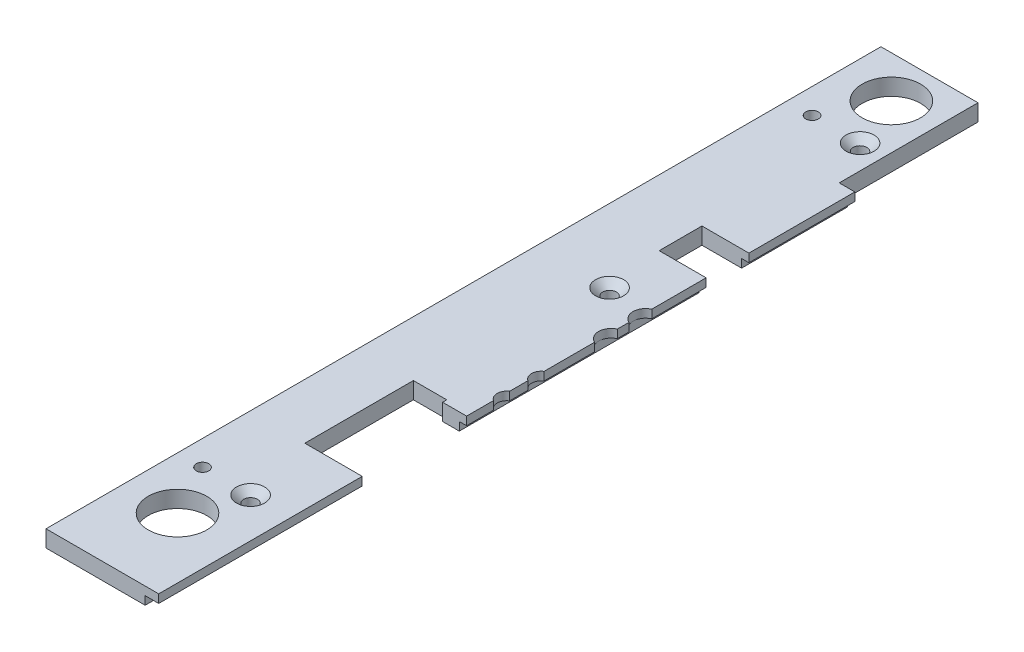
ISO-10303-21;
HEADER;
FILE_DESCRIPTION(('STEP AP214'),'2;1');
FILE_NAME('part.step','',(''),(''),'','','');
FILE_SCHEMA(('AUTOMOTIVE_DESIGN { 1 0 10303 214 1 1 1 1 }'));
ENDSEC;
DATA;
#1=APPLICATION_CONTEXT('core data for automotive mechanical design processes');
#2=APPLICATION_PROTOCOL_DEFINITION('international standard','automotive_design',2000,#1);
#3=PRODUCT_CONTEXT('',#1,'mechanical');
#4=PRODUCT('Part','Part','',(#3));
#5=PRODUCT_RELATED_PRODUCT_CATEGORY('part','',(#4));
#6=PRODUCT_DEFINITION_FORMATION('','',#4);
#7=PRODUCT_DEFINITION_CONTEXT('part definition',#1,'design');
#8=PRODUCT_DEFINITION('design','',#6,#7);
#9=PRODUCT_DEFINITION_SHAPE('','',#8);
#10=(LENGTH_UNIT() NAMED_UNIT(*) SI_UNIT(.MILLI.,.METRE.));
#11=(NAMED_UNIT(*) PLANE_ANGLE_UNIT() SI_UNIT($,.RADIAN.));
#12=(NAMED_UNIT(*) SI_UNIT($,.STERADIAN.) SOLID_ANGLE_UNIT());
#13=UNCERTAINTY_MEASURE_WITH_UNIT(LENGTH_MEASURE(1.E-05),#10,'distance_accuracy_value','');
#14=(GEOMETRIC_REPRESENTATION_CONTEXT(3) GLOBAL_UNCERTAINTY_ASSIGNED_CONTEXT((#13)) GLOBAL_UNIT_ASSIGNED_CONTEXT((#10,
#11,#12)) REPRESENTATION_CONTEXT('',''));
#15=CARTESIAN_POINT('',(0.,0.,0.));
#16=DIRECTION('',(0.,0.,1.));
#17=DIRECTION('',(1.,0.,0.));
#18=AXIS2_PLACEMENT_3D('',#15,#16,#17);
#19=CARTESIAN_POINT('',(54.,0.,400.));
#20=DIRECTION('',(-1.,0.,0.));
#21=DIRECTION('',(0.,0.,1.));
#22=AXIS2_PLACEMENT_3D('',#19,#20,#21);
#23=PLANE('',#22);
#24=DIRECTION('',(0.,1.,0.));
#25=VECTOR('',#24,1.);
#26=CARTESIAN_POINT('',(54.,0.,180.295643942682));
#27=LINE('',#26,#25);
#28=CARTESIAN_POINT('',(54.,8.00000000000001,180.295643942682));
#29=VERTEX_POINT('',#28);
#30=CARTESIAN_POINT('',(54.,4.,180.295643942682));
#31=VERTEX_POINT('',#30);
#32=EDGE_CURVE('E328',#29,#31,#27,.F.);
#33=ORIENTED_EDGE('',*,*,#32,.T.);
#34=DIRECTION('',(0.,0.,1.));
#35=VECTOR('',#34,1.);
#36=CARTESIAN_POINT('',(54.,4.,0.));
#37=LINE('',#36,#35);
#38=CARTESIAN_POINT('',(54.,4.,174.704356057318));
#39=VERTEX_POINT('',#38);
#40=EDGE_CURVE('E969',#39,#31,#37,.T.);
#41=ORIENTED_EDGE('',*,*,#40,.F.);
#42=DIRECTION('',(0.,1.,0.));
#43=VECTOR('',#42,1.);
#44=CARTESIAN_POINT('',(54.,0.,174.704356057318));
#45=LINE('',#44,#43);
#46=CARTESIAN_POINT('',(54.,8.00000000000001,174.704356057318));
#47=VERTEX_POINT('',#46);
#48=EDGE_CURVE('E325',#39,#47,#45,.T.);
#49=ORIENTED_EDGE('',*,*,#48,.T.);
#50=DIRECTION('',(0.,0.,-1.));
#51=VECTOR('',#50,1.);
#52=CARTESIAN_POINT('',(54.,8.00000000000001,400.));
#53=LINE('',#52,#51);
#54=EDGE_CURVE('E449',#29,#47,#53,.T.);
#55=ORIENTED_EDGE('',*,*,#54,.F.);
#56=EDGE_LOOP('',(#33,#41,#49,#55));
#57=FACE_BOUND('',#56,.T.);
#58=ADVANCED_FACE('F33',(#57),#23,.F.);
#59=DIRECTION('',(0.,1.,0.));
#60=VECTOR('',#59,1.);
#61=CARTESIAN_POINT('',(54.,0.,215.388653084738));
#62=LINE('',#61,#60);
#63=CARTESIAN_POINT('',(54.,8.00000000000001,215.388653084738));
#64=VERTEX_POINT('',#63);
#65=CARTESIAN_POINT('',(54.,4.,215.388653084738));
#66=VERTEX_POINT('',#65);
#67=EDGE_CURVE('E378',#64,#66,#62,.F.);
#68=ORIENTED_EDGE('',*,*,#67,.T.);
#69=CARTESIAN_POINT('',(54.,4.,191.204356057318));
#70=VERTEX_POINT('',#69);
#71=EDGE_CURVE('E966',#70,#66,#37,.T.);
#72=ORIENTED_EDGE('',*,*,#71,.F.);
#73=DIRECTION('',(0.,1.,0.));
#74=VECTOR('',#73,1.);
#75=CARTESIAN_POINT('',(54.,0.,191.204356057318));
#76=LINE('',#75,#74);
#77=CARTESIAN_POINT('',(54.,8.00000000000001,191.204356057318));
#78=VERTEX_POINT('',#77);
#79=EDGE_CURVE('E338',#70,#78,#76,.T.);
#80=ORIENTED_EDGE('',*,*,#79,.T.);
#81=EDGE_CURVE('E447',#64,#78,#53,.T.);
#82=ORIENTED_EDGE('',*,*,#81,.F.);
#83=EDGE_LOOP('',(#68,#72,#80,#82));
#84=FACE_BOUND('',#83,.T.);
#85=ADVANCED_FACE('F633',(#84),#23,.F.);
#86=DIRECTION('',(0.,1.,0.));
#87=VECTOR('',#86,1.);
#88=CARTESIAN_POINT('',(54.,0.,163.795643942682));
#89=LINE('',#88,#87);
#90=CARTESIAN_POINT('',(54.,8.00000000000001,163.795643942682));
#91=VERTEX_POINT('',#90);
#92=CARTESIAN_POINT('',(54.,4.,163.795643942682));
#93=VERTEX_POINT('',#92);
#94=EDGE_CURVE('E319',#91,#93,#89,.F.);
#95=ORIENTED_EDGE('',*,*,#94,.T.);
#96=CARTESIAN_POINT('',(54.,4.,137.75));
#97=VERTEX_POINT('',#96);
#98=EDGE_CURVE('E56',#97,#93,#37,.T.);
#99=ORIENTED_EDGE('',*,*,#98,.F.);
#100=DIRECTION('',(0.,1.,0.));
#101=VECTOR('',#100,1.);
#102=CARTESIAN_POINT('',(54.,0.,137.75));
#103=LINE('',#102,#101);
#104=CARTESIAN_POINT('',(54.,8.00000000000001,137.75));
#105=VERTEX_POINT('',#104);
#106=EDGE_CURVE('E376',#97,#105,#103,.T.);
#107=ORIENTED_EDGE('',*,*,#106,.T.);
#108=EDGE_CURVE('E295',#91,#105,#53,.T.);
#109=ORIENTED_EDGE('',*,*,#108,.F.);
#110=EDGE_LOOP('',(#95,#99,#107,#109));
#111=FACE_BOUND('',#110,.T.);
#112=ADVANCED_FACE('F323',(#111),#23,.F.);
#113=DIRECTION('',(0.,1.,0.));
#114=VECTOR('',#113,1.);
#115=CARTESIAN_POINT('',(54.,0.,231.888653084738));
#116=LINE('',#115,#114);
#117=CARTESIAN_POINT('',(54.,8.00000000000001,231.888653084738));
#118=VERTEX_POINT('',#117);
#119=CARTESIAN_POINT('',(54.,4.,231.888653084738));
#120=VERTEX_POINT('',#119);
#121=EDGE_CURVE('E388',#118,#120,#116,.F.);
#122=ORIENTED_EDGE('',*,*,#121,.T.);
#123=CARTESIAN_POINT('',(54.,4.,223.111346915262));
#124=VERTEX_POINT('',#123);
#125=EDGE_CURVE('E247',#124,#120,#37,.T.);
#126=ORIENTED_EDGE('',*,*,#125,.F.);
#127=DIRECTION('',(0.,1.,0.));
#128=VECTOR('',#127,1.);
#129=CARTESIAN_POINT('',(54.,0.,223.111346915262));
#130=LINE('',#129,#128);
#131=CARTESIAN_POINT('',(54.,8.00000000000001,223.111346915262));
#132=VERTEX_POINT('',#131);
#133=EDGE_CURVE('E386',#124,#132,#130,.T.);
#134=ORIENTED_EDGE('',*,*,#133,.T.);
#135=EDGE_CURVE('E446',#118,#132,#53,.T.);
#136=ORIENTED_EDGE('',*,*,#135,.F.);
#137=EDGE_LOOP('',(#122,#126,#134,#136));
#138=FACE_BOUND('',#137,.T.);
#139=ADVANCED_FACE('F650',(#138),#23,.F.);
#140=DIRECTION('',(0.,-1.,0.));
#141=VECTOR('',#140,1.);
#142=CARTESIAN_POINT('',(54.,0.,252.5));
#143=LINE('',#142,#141);
#144=CARTESIAN_POINT('',(54.,8.00000000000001,252.5));
#145=VERTEX_POINT('',#144);
#146=CARTESIAN_POINT('',(54.,4.,252.5));
#147=VERTEX_POINT('',#146);
#148=EDGE_CURVE('E254',#145,#147,#143,.T.);
#149=ORIENTED_EDGE('',*,*,#148,.T.);
#150=CARTESIAN_POINT('',(54.,4.,239.611346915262));
#151=VERTEX_POINT('',#150);
#152=EDGE_CURVE('E236',#151,#147,#37,.T.);
#153=ORIENTED_EDGE('',*,*,#152,.F.);
#154=DIRECTION('',(0.,1.,0.));
#155=VECTOR('',#154,1.);
#156=CARTESIAN_POINT('',(54.,0.,239.611346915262));
#157=LINE('',#156,#155);
#158=CARTESIAN_POINT('',(54.,8.00000000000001,239.611346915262));
#159=VERTEX_POINT('',#158);
#160=EDGE_CURVE('E391',#151,#159,#157,.T.);
#161=ORIENTED_EDGE('',*,*,#160,.T.);
#162=EDGE_CURVE('E262',#145,#159,#53,.T.);
#163=ORIENTED_EDGE('',*,*,#162,.F.);
#164=EDGE_LOOP('',(#149,#153,#161,#163));
#165=FACE_BOUND('',#164,.T.);
#166=ADVANCED_FACE('F260',(#165),#23,.F.);
#167=DIRECTION('',(0.,1.,0.));
#168=VECTOR('',#167,1.);
#169=CARTESIAN_POINT('',(54.,0.,117.25));
#170=LINE('',#169,#168);
#171=CARTESIAN_POINT('',(54.,4.,117.25));
#172=VERTEX_POINT('',#171);
#173=CARTESIAN_POINT('',(54.,8.00000000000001,117.25));
#174=VERTEX_POINT('',#173);
#175=EDGE_CURVE('E375',#172,#174,#170,.T.);
#176=ORIENTED_EDGE('',*,*,#175,.F.);
#177=CARTESIAN_POINT('',(54.,4.,66.4929440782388));
#178=VERTEX_POINT('',#177);
#179=EDGE_CURVE('E250',#178,#172,#37,.T.);
#180=ORIENTED_EDGE('',*,*,#179,.F.);
#181=DIRECTION('',(0.,1.,0.));
#182=VECTOR('',#181,1.);
#183=CARTESIAN_POINT('',(54.,0.,66.4929440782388));
#184=LINE('',#183,#182);
#185=CARTESIAN_POINT('',(54.,8.00000000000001,66.4929440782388));
#186=VERTEX_POINT('',#185);
#187=EDGE_CURVE('E353',#178,#186,#184,.T.);
#188=ORIENTED_EDGE('',*,*,#187,.T.);
#189=EDGE_CURVE('E290',#174,#186,#53,.T.);
#190=ORIENTED_EDGE('',*,*,#189,.F.);
#191=EDGE_LOOP('',(#176,#180,#188,#190));
#192=FACE_BOUND('',#191,.T.);
#193=ADVANCED_FACE('F469',(#192),#23,.F.);
#194=CARTESIAN_POINT('',(0.,0.,400.));
#195=DIRECTION('',(1.,0.,0.));
#196=DIRECTION('',(0.,0.,-1.));
#197=AXIS2_PLACEMENT_3D('',#194,#195,#196);
#198=PLANE('',#197);
#199=DIRECTION('',(0.,-1.,0.));
#200=VECTOR('',#199,1.);
#201=CARTESIAN_POINT('',(0.,0.,0.));
#202=LINE('',#201,#200);
#203=CARTESIAN_POINT('',(0.,8.00000000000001,0.));
#204=VERTEX_POINT('',#203);
#205=CARTESIAN_POINT('',(0.,0.,0.));
#206=VERTEX_POINT('',#205);
#207=EDGE_CURVE('E263',#204,#206,#202,.T.);
#208=ORIENTED_EDGE('',*,*,#207,.T.);
#209=DIRECTION('',(0.,0.,-1.));
#210=VECTOR('',#209,1.);
#211=CARTESIAN_POINT('',(0.,0.,400.));
#212=LINE('',#211,#210);
#213=CARTESIAN_POINT('',(0.,0.,400.));
#214=VERTEX_POINT('',#213);
#215=EDGE_CURVE('E294',#214,#206,#212,.T.);
#216=ORIENTED_EDGE('',*,*,#215,.F.);
#217=DIRECTION('',(0.,-1.,0.));
#218=VECTOR('',#217,1.);
#219=CARTESIAN_POINT('',(0.,0.,400.));
#220=LINE('',#219,#218);
#221=CARTESIAN_POINT('',(0.,8.00000000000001,400.));
#222=VERTEX_POINT('',#221);
#223=EDGE_CURVE('E277',#222,#214,#220,.T.);
#224=ORIENTED_EDGE('',*,*,#223,.F.);
#225=DIRECTION('',(0.,0.,-1.));
#226=VECTOR('',#225,1.);
#227=CARTESIAN_POINT('',(0.,8.00000000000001,400.));
#228=LINE('',#227,#226);
#229=EDGE_CURVE('E287',#222,#204,#228,.T.);
#230=ORIENTED_EDGE('',*,*,#229,.T.);
#231=EDGE_LOOP('',(#208,#216,#224,#230));
#232=FACE_BOUND('',#231,.T.);
#233=ADVANCED_FACE('F35',(#232),#198,.F.);
#234=CARTESIAN_POINT('',(0.,0.,400.));
#235=DIRECTION('',(0.,1.,0.));
#236=DIRECTION('',(-1.,0.,0.));
#237=AXIS2_PLACEMENT_3D('',#234,#235,#236);
#238=PLANE('',#237);
#239=CARTESIAN_POINT('',(12.,0.,44.9999999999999));
#240=DIRECTION('',(0.,1.,0.));
#241=DIRECTION('',(-1.,0.,0.));
#242=AXIS2_PLACEMENT_3D('',#239,#240,#241);
#243=CIRCLE('',#242,3.);
#244=CARTESIAN_POINT('',(9.00000000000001,0.,44.9999999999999));
#245=VERTEX_POINT('',#244);
#246=EDGE_CURVE('E589',#245,#245,#243,.T.);
#247=ORIENTED_EDGE('',*,*,#246,.T.);
#248=EDGE_LOOP('',(#247));
#249=FACE_BOUND('',#248,.T.);
#250=CARTESIAN_POINT('',(12.,0.,337.));
#251=DIRECTION('',(0.,1.,0.));
#252=DIRECTION('',(-1.,0.,0.));
#253=AXIS2_PLACEMENT_3D('',#250,#251,#252);
#254=CIRCLE('',#253,3.);
#255=CARTESIAN_POINT('',(8.99999999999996,0.,337.));
#256=VERTEX_POINT('',#255);
#257=EDGE_CURVE('E583',#256,#256,#254,.T.);
#258=ORIENTED_EDGE('',*,*,#257,.T.);
#259=EDGE_LOOP('',(#258));
#260=FACE_BOUND('',#259,.T.);
#261=CARTESIAN_POINT('',(35.,0.,44.9999999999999));
#262=DIRECTION('',(0.,1.,0.));
#263=DIRECTION('',(0.,0.,1.));
#264=AXIS2_PLACEMENT_3D('',#261,#262,#263);
#265=CIRCLE('',#264,3.3);
#266=CARTESIAN_POINT('',(35.,0.,48.2999999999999));
#267=VERTEX_POINT('',#266);
#268=EDGE_CURVE('E580',#267,#267,#265,.T.);
#269=ORIENTED_EDGE('',*,*,#268,.T.);
#270=EDGE_LOOP('',(#269));
#271=FACE_BOUND('',#270,.T.);
#272=CARTESIAN_POINT('',(35.,0.,337.));
#273=DIRECTION('',(0.,1.,0.));
#274=DIRECTION('',(0.,0.,1.));
#275=AXIS2_PLACEMENT_3D('',#272,#273,#274);
#276=CIRCLE('',#275,3.3);
#277=CARTESIAN_POINT('',(35.,0.,340.3));
#278=VERTEX_POINT('',#277);
#279=EDGE_CURVE('E571',#278,#278,#276,.T.);
#280=ORIENTED_EDGE('',*,*,#279,.T.);
#281=EDGE_LOOP('',(#280));
#282=FACE_BOUND('',#281,.T.);
#283=CARTESIAN_POINT('',(35.,0.,165.));
#284=DIRECTION('',(0.,1.,0.));
#285=DIRECTION('',(0.,0.,1.));
#286=AXIS2_PLACEMENT_3D('',#283,#284,#285);
#287=CIRCLE('',#286,3.3);
#288=CARTESIAN_POINT('',(35.,0.,168.3));
#289=VERTEX_POINT('',#288);
#290=EDGE_CURVE('E562',#289,#289,#287,.T.);
#291=ORIENTED_EDGE('',*,*,#290,.T.);
#292=EDGE_LOOP('',(#291));
#293=FACE_BOUND('',#292,.T.);
#294=CARTESIAN_POINT('',(25.,0.,362.));
#295=DIRECTION('',(0.,1.,0.));
#296=DIRECTION('',(-1.,0.,0.));
#297=AXIS2_PLACEMENT_3D('',#294,#295,#296);
#298=CIRCLE('',#297,14.);
#299=CARTESIAN_POINT('',(10.9999999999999,0.,362.));
#300=VERTEX_POINT('',#299);
#301=EDGE_CURVE('E550',#300,#300,#298,.T.);
#302=ORIENTED_EDGE('',*,*,#301,.T.);
#303=EDGE_LOOP('',(#302));
#304=FACE_BOUND('',#303,.T.);
#305=CARTESIAN_POINT('',(25.,0.,19.9999999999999));
#306=DIRECTION('',(0.,1.,0.));
#307=DIRECTION('',(-1.,0.,0.));
#308=AXIS2_PLACEMENT_3D('',#305,#306,#307);
#309=CIRCLE('',#308,14.0000000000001);
#310=CARTESIAN_POINT('',(10.9999999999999,0.,19.9999999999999));
#311=VERTEX_POINT('',#310);
#312=EDGE_CURVE('E257',#311,#311,#309,.T.);
#313=ORIENTED_EDGE('',*,*,#312,.T.);
#314=EDGE_LOOP('',(#313));
#315=FACE_BOUND('',#314,.T.);
#316=DIRECTION('',(1.,0.,0.));
#317=VECTOR('',#316,1.);
#318=CARTESIAN_POINT('',(54.,0.,66.4929440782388));
#319=LINE('',#318,#317);
#320=CARTESIAN_POINT('',(46.5,0.,66.4929440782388));
#321=VERTEX_POINT('',#320);
#322=CARTESIAN_POINT('',(50.5,0.,66.4929440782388));
#323=VERTEX_POINT('',#322);
#324=EDGE_CURVE('E349',#321,#323,#319,.T.);
#325=ORIENTED_EDGE('',*,*,#324,.T.);
#326=DIRECTION('',(0.,0.,1.));
#327=VECTOR('',#326,1.);
#328=CARTESIAN_POINT('',(50.5,0.,0.));
#329=LINE('',#328,#327);
#330=CARTESIAN_POINT('',(50.5,0.,117.25));
#331=VERTEX_POINT('',#330);
#332=EDGE_CURVE('E537',#323,#331,#329,.T.);
#333=ORIENTED_EDGE('',*,*,#332,.T.);
#334=DIRECTION('',(-1.,0.,0.));
#335=VECTOR('',#334,1.);
#336=CARTESIAN_POINT('',(54.,0.,117.25));
#337=LINE('',#336,#335);
#338=CARTESIAN_POINT('',(31.5,0.,117.25));
#339=VERTEX_POINT('',#338);
#340=EDGE_CURVE('E367',#331,#339,#337,.T.);
#341=ORIENTED_EDGE('',*,*,#340,.T.);
#342=DIRECTION('',(0.,0.,1.));
#343=VECTOR('',#342,1.);
#344=CARTESIAN_POINT('',(31.5,0.,117.25));
#345=LINE('',#344,#343);
#346=CARTESIAN_POINT('',(31.5,0.,137.75));
#347=VERTEX_POINT('',#346);
#348=EDGE_CURVE('E369',#339,#347,#345,.T.);
#349=ORIENTED_EDGE('',*,*,#348,.T.);
#350=DIRECTION('',(1.,0.,0.));
#351=VECTOR('',#350,1.);
#352=CARTESIAN_POINT('',(54.,0.,137.75));
#353=LINE('',#352,#351);
#354=CARTESIAN_POINT('',(50.5,0.,137.75));
#355=VERTEX_POINT('',#354);
#356=EDGE_CURVE('E372',#347,#355,#353,.T.);
#357=ORIENTED_EDGE('',*,*,#356,.T.);
#358=CARTESIAN_POINT('',(50.5,0.,252.5));
#359=VERTEX_POINT('',#358);
#360=EDGE_CURVE('E542',#355,#359,#329,.T.);
#361=ORIENTED_EDGE('',*,*,#360,.T.);
#362=DIRECTION('',(-1.,0.,0.));
#363=VECTOR('',#362,1.);
#364=CARTESIAN_POINT('',(42.4999999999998,0.,252.5));
#365=LINE('',#364,#363);
#366=CARTESIAN_POINT('',(42.4999999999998,0.,252.5));
#367=VERTEX_POINT('',#366);
#368=EDGE_CURVE('E416',#359,#367,#365,.T.);
#369=ORIENTED_EDGE('',*,*,#368,.T.);
#370=DIRECTION('',(0.,0.,-1.));
#371=VECTOR('',#370,1.);
#372=CARTESIAN_POINT('',(42.4999999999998,0.,252.5));
#373=LINE('',#372,#371);
#374=CARTESIAN_POINT('',(42.4999999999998,0.,250.5));
#375=VERTEX_POINT('',#374);
#376=EDGE_CURVE('E404',#367,#375,#373,.T.);
#377=ORIENTED_EDGE('',*,*,#376,.T.);
#378=DIRECTION('',(-1.,0.,0.));
#379=VECTOR('',#378,1.);
#380=CARTESIAN_POINT('',(42.4999999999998,0.,250.5));
#381=LINE('',#380,#379);
#382=CARTESIAN_POINT('',(26.4999999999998,0.,250.5));
#383=VERTEX_POINT('',#382);
#384=EDGE_CURVE('E407',#375,#383,#381,.T.);
#385=ORIENTED_EDGE('',*,*,#384,.T.);
#386=DIRECTION('',(0.,0.,1.));
#387=VECTOR('',#386,1.);
#388=CARTESIAN_POINT('',(26.4999999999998,0.,250.5));
#389=LINE('',#388,#387);
#390=CARTESIAN_POINT('',(26.4999999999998,0.,302.5));
#391=VERTEX_POINT('',#390);
#392=EDGE_CURVE('E410',#383,#391,#389,.T.);
#393=ORIENTED_EDGE('',*,*,#392,.T.);
#394=DIRECTION('',(1.,0.,0.));
#395=VECTOR('',#394,1.);
#396=CARTESIAN_POINT('',(26.4999999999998,0.,302.5));
#397=LINE('',#396,#395);
#398=CARTESIAN_POINT('',(47.5,0.,302.5));
#399=VERTEX_POINT('',#398);
#400=EDGE_CURVE('E413',#391,#399,#397,.T.);
#401=ORIENTED_EDGE('',*,*,#400,.T.);
#402=DIRECTION('',(0.,0.,1.));
#403=VECTOR('',#402,1.);
#404=CARTESIAN_POINT('',(47.5,0.,-0.000999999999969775));
#405=LINE('',#404,#403);
#406=CARTESIAN_POINT('',(47.5,0.,400.));
#407=VERTEX_POINT('',#406);
#408=EDGE_CURVE('E506',#399,#407,#405,.T.);
#409=ORIENTED_EDGE('',*,*,#408,.T.);
#410=DIRECTION('',(1.,0.,0.));
#411=VECTOR('',#410,1.);
#412=CARTESIAN_POINT('',(0.,0.,400.));
#413=LINE('',#412,#411);
#414=EDGE_CURVE('E280',#214,#407,#413,.T.);
#415=ORIENTED_EDGE('',*,*,#414,.F.);
#416=ORIENTED_EDGE('',*,*,#215,.T.);
#417=DIRECTION('',(1.,0.,0.));
#418=VECTOR('',#417,1.);
#419=CARTESIAN_POINT('',(0.,0.,0.));
#420=LINE('',#419,#418);
#421=CARTESIAN_POINT('',(46.5,0.,0.));
#422=VERTEX_POINT('',#421);
#423=EDGE_CURVE('E267',#206,#422,#420,.T.);
#424=ORIENTED_EDGE('',*,*,#423,.T.);
#425=DIRECTION('',(0.,0.,1.));
#426=VECTOR('',#425,1.);
#427=CARTESIAN_POINT('',(46.5,0.,0.));
#428=LINE('',#427,#426);
#429=EDGE_CURVE('E346',#422,#321,#428,.T.);
#430=ORIENTED_EDGE('',*,*,#429,.T.);
#431=EDGE_LOOP('',(#325,#333,#341,#349,#357,#361,#369,#377,#385,#393,#401,#409,#415,#416,#424,#430));
#432=FACE_BOUND('',#431,.T.);
#433=ADVANCED_FACE('F440',(#249,#260,#271,#282,#293,#304,#315,#432),#238,.F.);
#434=DIRECTION('',(0.,1.,0.));
#435=VECTOR('',#434,1.);
#436=CARTESIAN_POINT('',(54.,0.,400.));
#437=LINE('',#436,#435);
#438=CARTESIAN_POINT('',(54.,4.,400.));
#439=VERTEX_POINT('',#438);
#440=CARTESIAN_POINT('',(54.,8.00000000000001,400.));
#441=VERTEX_POINT('',#440);
#442=EDGE_CURVE('E283',#439,#441,#437,.T.);
#443=ORIENTED_EDGE('',*,*,#442,.F.);
#444=DIRECTION('',(0.,0.,1.));
#445=VECTOR('',#444,1.);
#446=CARTESIAN_POINT('',(54.,4.,-0.000999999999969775));
#447=LINE('',#446,#445);
#448=CARTESIAN_POINT('',(54.,4.,302.5));
#449=VERTEX_POINT('',#448);
#450=EDGE_CURVE('E500',#449,#439,#447,.T.);
#451=ORIENTED_EDGE('',*,*,#450,.F.);
#452=DIRECTION('',(0.,1.,0.));
#453=VECTOR('',#452,1.);
#454=CARTESIAN_POINT('',(54.,0.,302.5));
#455=LINE('',#454,#453);
#456=CARTESIAN_POINT('',(54.,8.00000000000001,302.5));
#457=VERTEX_POINT('',#456);
#458=EDGE_CURVE('E264',#449,#457,#455,.T.);
#459=ORIENTED_EDGE('',*,*,#458,.T.);
#460=EDGE_CURVE('E291',#441,#457,#53,.T.);
#461=ORIENTED_EDGE('',*,*,#460,.F.);
#462=EDGE_LOOP('',(#443,#451,#459,#461));
#463=FACE_BOUND('',#462,.T.);
#464=ADVANCED_FACE('F498',(#463),#23,.F.);
#465=CARTESIAN_POINT('',(0.,8.00000000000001,400.));
#466=DIRECTION('',(0.,-1.,0.));
#467=DIRECTION('',(1.,0.,0.));
#468=AXIS2_PLACEMENT_3D('',#465,#466,#467);
#469=PLANE('',#468);
#470=CARTESIAN_POINT('',(12.,8.00000000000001,44.9999999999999));
#471=DIRECTION('',(0.,1.,0.));
#472=DIRECTION('',(-1.,0.,0.));
#473=AXIS2_PLACEMENT_3D('',#470,#471,#472);
#474=CIRCLE('',#473,3.);
#475=CARTESIAN_POINT('',(9.00000000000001,8.00000000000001,44.9999999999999));
#476=VERTEX_POINT('',#475);
#477=EDGE_CURVE('E592',#476,#476,#474,.T.);
#478=ORIENTED_EDGE('',*,*,#477,.F.);
#479=EDGE_LOOP('',(#478));
#480=FACE_BOUND('',#479,.T.);
#481=CARTESIAN_POINT('',(12.,8.00000000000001,337.));
#482=DIRECTION('',(0.,1.,0.));
#483=DIRECTION('',(-1.,0.,0.));
#484=AXIS2_PLACEMENT_3D('',#481,#482,#483);
#485=CIRCLE('',#484,3.);
#486=CARTESIAN_POINT('',(8.99999999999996,8.00000000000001,337.));
#487=VERTEX_POINT('',#486);
#488=EDGE_CURVE('E586',#487,#487,#485,.T.);
#489=ORIENTED_EDGE('',*,*,#488,.F.);
#490=EDGE_LOOP('',(#489));
#491=FACE_BOUND('',#490,.T.);
#492=CARTESIAN_POINT('',(35.,8.00000000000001,44.9999999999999));
#493=DIRECTION('',(0.,1.,0.));
#494=DIRECTION('',(0.,0.,1.));
#495=AXIS2_PLACEMENT_3D('',#492,#493,#494);
#496=CIRCLE('',#495,6.72);
#497=CARTESIAN_POINT('',(35.,8.00000000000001,51.7199999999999));
#498=VERTEX_POINT('',#497);
#499=EDGE_CURVE('E574',#498,#498,#496,.T.);
#500=ORIENTED_EDGE('',*,*,#499,.F.);
#501=EDGE_LOOP('',(#500));
#502=FACE_BOUND('',#501,.T.);
#503=CARTESIAN_POINT('',(35.,8.00000000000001,337.));
#504=DIRECTION('',(0.,1.,0.));
#505=DIRECTION('',(0.,0.,1.));
#506=AXIS2_PLACEMENT_3D('',#503,#504,#505);
#507=CIRCLE('',#506,6.72);
#508=CARTESIAN_POINT('',(35.,8.00000000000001,343.72));
#509=VERTEX_POINT('',#508);
#510=EDGE_CURVE('E565',#509,#509,#507,.T.);
#511=ORIENTED_EDGE('',*,*,#510,.F.);
#512=EDGE_LOOP('',(#511));
#513=FACE_BOUND('',#512,.T.);
#514=CARTESIAN_POINT('',(35.,8.00000000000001,165.));
#515=DIRECTION('',(0.,1.,0.));
#516=DIRECTION('',(0.,0.,1.));
#517=AXIS2_PLACEMENT_3D('',#514,#515,#516);
#518=CIRCLE('',#517,6.72);
#519=CARTESIAN_POINT('',(35.,8.00000000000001,171.72));
#520=VERTEX_POINT('',#519);
#521=EDGE_CURVE('E556',#520,#520,#518,.T.);
#522=ORIENTED_EDGE('',*,*,#521,.F.);
#523=EDGE_LOOP('',(#522));
#524=FACE_BOUND('',#523,.T.);
#525=CARTESIAN_POINT('',(25.,8.00000000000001,362.));
#526=DIRECTION('',(0.,1.,0.));
#527=DIRECTION('',(-1.,0.,0.));
#528=AXIS2_PLACEMENT_3D('',#525,#526,#527);
#529=CIRCLE('',#528,14.);
#530=CARTESIAN_POINT('',(10.9999999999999,8.00000000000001,362.));
#531=VERTEX_POINT('',#530);
#532=EDGE_CURVE('E553',#531,#531,#529,.T.);
#533=ORIENTED_EDGE('',*,*,#532,.F.);
#534=EDGE_LOOP('',(#533));
#535=FACE_BOUND('',#534,.T.);
#536=CARTESIAN_POINT('',(25.,8.00000000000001,19.9999999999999));
#537=DIRECTION('',(0.,1.,0.));
#538=DIRECTION('',(-1.,0.,0.));
#539=AXIS2_PLACEMENT_3D('',#536,#537,#538);
#540=CIRCLE('',#539,14.0000000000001);
#541=CARTESIAN_POINT('',(10.9999999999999,8.00000000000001,19.9999999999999));
#542=VERTEX_POINT('',#541);
#543=EDGE_CURVE('E547',#542,#542,#540,.T.);
#544=ORIENTED_EDGE('',*,*,#543,.F.);
#545=EDGE_LOOP('',(#544));
#546=FACE_BOUND('',#545,.T.);
#547=ORIENTED_EDGE('',*,*,#54,.T.);
#548=CARTESIAN_POINT('',(56.5,8.00000000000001,169.25));
#549=DIRECTION('',(0.,-1.,0.));
#550=DIRECTION('',(1.,0.,0.));
#551=AXIS2_PLACEMENT_3D('',#548,#549,#550);
#552=CIRCLE('',#551,5.99999999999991);
#553=EDGE_CURVE('E308',#47,#91,#552,.T.);
#554=ORIENTED_EDGE('',*,*,#553,.T.);
#555=ORIENTED_EDGE('',*,*,#108,.T.);
#556=DIRECTION('',(1.,0.,0.));
#557=VECTOR('',#556,1.);
#558=CARTESIAN_POINT('',(54.,8.00000000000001,137.75));
#559=LINE('',#558,#557);
#560=CARTESIAN_POINT('',(31.5,8.00000000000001,137.75));
#561=VERTEX_POINT('',#560);
#562=EDGE_CURVE('E364',#561,#105,#559,.T.);
#563=ORIENTED_EDGE('',*,*,#562,.F.);
#564=DIRECTION('',(0.,0.,1.));
#565=VECTOR('',#564,1.);
#566=CARTESIAN_POINT('',(31.5,8.00000000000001,117.25));
#567=LINE('',#566,#565);
#568=CARTESIAN_POINT('',(31.5,8.00000000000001,117.25));
#569=VERTEX_POINT('',#568);
#570=EDGE_CURVE('E361',#569,#561,#567,.T.);
#571=ORIENTED_EDGE('',*,*,#570,.F.);
#572=DIRECTION('',(-1.,0.,0.));
#573=VECTOR('',#572,1.);
#574=CARTESIAN_POINT('',(54.,8.00000000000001,117.25));
#575=LINE('',#574,#573);
#576=EDGE_CURVE('E355',#174,#569,#575,.T.);
#577=ORIENTED_EDGE('',*,*,#576,.F.);
#578=ORIENTED_EDGE('',*,*,#189,.T.);
#579=DIRECTION('',(1.,0.,0.));
#580=VECTOR('',#579,1.);
#581=CARTESIAN_POINT('',(54.,8.00000000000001,66.4929440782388));
#582=LINE('',#581,#580);
#583=CARTESIAN_POINT('',(46.5,8.00000000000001,66.4929440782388));
#584=VERTEX_POINT('',#583);
#585=EDGE_CURVE('E343',#584,#186,#582,.T.);
#586=ORIENTED_EDGE('',*,*,#585,.F.);
#587=DIRECTION('',(0.,0.,1.));
#588=VECTOR('',#587,1.);
#589=CARTESIAN_POINT('',(46.5,8.00000000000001,0.));
#590=LINE('',#589,#588);
#591=CARTESIAN_POINT('',(46.5,8.00000000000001,0.));
#592=VERTEX_POINT('',#591);
#593=EDGE_CURVE('E340',#592,#584,#590,.T.);
#594=ORIENTED_EDGE('',*,*,#593,.F.);
#595=DIRECTION('',(-1.,0.,0.));
#596=VECTOR('',#595,1.);
#597=CARTESIAN_POINT('',(0.,8.00000000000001,0.));
#598=LINE('',#597,#596);
#599=EDGE_CURVE('E275',#592,#204,#598,.T.);
#600=ORIENTED_EDGE('',*,*,#599,.T.);
#601=ORIENTED_EDGE('',*,*,#229,.F.);
#602=DIRECTION('',(-1.,0.,0.));
#603=VECTOR('',#602,1.);
#604=CARTESIAN_POINT('',(0.,8.00000000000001,400.));
#605=LINE('',#604,#603);
#606=EDGE_CURVE('E285',#441,#222,#605,.T.);
#607=ORIENTED_EDGE('',*,*,#606,.F.);
#608=ORIENTED_EDGE('',*,*,#460,.T.);
#609=DIRECTION('',(1.,0.,0.));
#610=VECTOR('',#609,1.);
#611=CARTESIAN_POINT('',(26.4999999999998,8.00000000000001,302.5));
#612=LINE('',#611,#610);
#613=CARTESIAN_POINT('',(26.4999999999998,8.00000000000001,302.5));
#614=VERTEX_POINT('',#613);
#615=EDGE_CURVE('E401',#614,#457,#612,.T.);
#616=ORIENTED_EDGE('',*,*,#615,.F.);
#617=DIRECTION('',(0.,0.,1.));
#618=VECTOR('',#617,1.);
#619=CARTESIAN_POINT('',(26.4999999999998,8.00000000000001,250.5));
#620=LINE('',#619,#618);
#621=CARTESIAN_POINT('',(26.4999999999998,8.00000000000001,250.5));
#622=VERTEX_POINT('',#621);
#623=EDGE_CURVE('E398',#622,#614,#620,.T.);
#624=ORIENTED_EDGE('',*,*,#623,.F.);
#625=DIRECTION('',(-1.,0.,0.));
#626=VECTOR('',#625,1.);
#627=CARTESIAN_POINT('',(42.4999999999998,8.00000000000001,250.5));
#628=LINE('',#627,#626);
#629=CARTESIAN_POINT('',(42.4999999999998,8.00000000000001,250.5));
#630=VERTEX_POINT('',#629);
#631=EDGE_CURVE('E395',#630,#622,#628,.T.);
#632=ORIENTED_EDGE('',*,*,#631,.F.);
#633=DIRECTION('',(0.,0.,-1.));
#634=VECTOR('',#633,1.);
#635=CARTESIAN_POINT('',(42.4999999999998,8.00000000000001,252.5));
#636=LINE('',#635,#634);
#637=CARTESIAN_POINT('',(42.4999999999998,8.00000000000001,252.5));
#638=VERTEX_POINT('',#637);
#639=EDGE_CURVE('E393',#638,#630,#636,.T.);
#640=ORIENTED_EDGE('',*,*,#639,.F.);
#641=DIRECTION('',(1.,0.,0.));
#642=VECTOR('',#641,1.);
#643=CARTESIAN_POINT('',(0.,8.00000000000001,252.5));
#644=LINE('',#643,#642);
#645=EDGE_CURVE('E298',#638,#145,#644,.T.);
#646=ORIENTED_EDGE('',*,*,#645,.T.);
#647=ORIENTED_EDGE('',*,*,#162,.T.);
#648=CARTESIAN_POINT('',(56.4999999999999,8.00000000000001,235.75));
#649=DIRECTION('',(0.,-1.,0.));
#650=DIRECTION('',(1.,0.,0.));
#651=AXIS2_PLACEMENT_3D('',#648,#649,#650);
#652=CIRCLE('',#651,4.6);
#653=EDGE_CURVE('E300',#159,#118,#652,.T.);
#654=ORIENTED_EDGE('',*,*,#653,.T.);
#655=ORIENTED_EDGE('',*,*,#135,.T.);
#656=CARTESIAN_POINT('',(56.4999999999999,8.00000000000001,219.25));
#657=DIRECTION('',(0.,-1.,0.));
#658=DIRECTION('',(1.,0.,0.));
#659=AXIS2_PLACEMENT_3D('',#656,#657,#658);
#660=CIRCLE('',#659,4.59999999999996);
#661=EDGE_CURVE('E303',#132,#64,#660,.T.);
#662=ORIENTED_EDGE('',*,*,#661,.T.);
#663=ORIENTED_EDGE('',*,*,#81,.T.);
#664=CARTESIAN_POINT('',(56.5,8.00000000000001,185.75));
#665=DIRECTION('',(0.,-1.,0.));
#666=DIRECTION('',(1.,0.,0.));
#667=AXIS2_PLACEMENT_3D('',#664,#665,#666);
#668=CIRCLE('',#667,6.);
#669=EDGE_CURVE('E306',#78,#29,#668,.T.);
#670=ORIENTED_EDGE('',*,*,#669,.T.);
#671=EDGE_LOOP('',(#547,#554,#555,#563,#571,#577,#578,#586,#594,#600,#601,#607,#608,#616,#624,
#632,#640,#646,#647,#654,#655,#662,#663,#670));
#672=FACE_BOUND('',#671,.T.);
#673=ADVANCED_FACE('F433',(#480,#491,#502,#513,#524,#535,#546,#672),#469,.F.);
#674=CARTESIAN_POINT('',(0.,8.00000000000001,400.));
#675=DIRECTION('',(0.,0.,-1.));
#676=DIRECTION('',(-1.,0.,0.));
#677=AXIS2_PLACEMENT_3D('',#674,#675,#676);
#678=PLANE('',#677);
#679=ORIENTED_EDGE('',*,*,#414,.T.);
#680=DIRECTION('',(0.,-1.,0.));
#681=VECTOR('',#680,1.);
#682=CARTESIAN_POINT('',(47.5,0.,400.));
#683=LINE('',#682,#681);
#684=CARTESIAN_POINT('',(47.5,4.,400.));
#685=VERTEX_POINT('',#684);
#686=EDGE_CURVE('E508',#685,#407,#683,.T.);
#687=ORIENTED_EDGE('',*,*,#686,.F.);
#688=DIRECTION('',(-1.,0.,0.));
#689=VECTOR('',#688,1.);
#690=CARTESIAN_POINT('',(54.,4.,400.));
#691=LINE('',#690,#689);
#692=EDGE_CURVE('E495',#439,#685,#691,.T.);
#693=ORIENTED_EDGE('',*,*,#692,.F.);
#694=ORIENTED_EDGE('',*,*,#442,.T.);
#695=ORIENTED_EDGE('',*,*,#606,.T.);
#696=ORIENTED_EDGE('',*,*,#223,.T.);
#697=EDGE_LOOP('',(#679,#687,#693,#694,#695,#696));
#698=FACE_BOUND('',#697,.T.);
#699=ADVANCED_FACE('F490',(#698),#678,.F.);
#700=CARTESIAN_POINT('',(0.,8.00000000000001,0.));
#701=DIRECTION('',(0.,0.,-1.));
#702=DIRECTION('',(-1.,0.,0.));
#703=AXIS2_PLACEMENT_3D('',#700,#701,#702);
#704=PLANE('',#703);
#705=DIRECTION('',(0.,1.,0.));
#706=VECTOR('',#705,1.);
#707=CARTESIAN_POINT('',(46.5,0.,0.));
#708=LINE('',#707,#706);
#709=EDGE_CURVE('E352',#422,#592,#708,.T.);
#710=ORIENTED_EDGE('',*,*,#709,.F.);
#711=ORIENTED_EDGE('',*,*,#423,.F.);
#712=ORIENTED_EDGE('',*,*,#207,.F.);
#713=ORIENTED_EDGE('',*,*,#599,.F.);
#714=EDGE_LOOP('',(#710,#711,#712,#713));
#715=FACE_BOUND('',#714,.T.);
#716=ADVANCED_FACE('F483',(#715),#704,.T.);
#717=CARTESIAN_POINT('',(42.4999999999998,0.,252.5));
#718=DIRECTION('',(0.,0.,-1.));
#719=DIRECTION('',(-1.,0.,0.));
#720=AXIS2_PLACEMENT_3D('',#717,#718,#719);
#721=PLANE('',#720);
#722=ORIENTED_EDGE('',*,*,#368,.F.);
#723=DIRECTION('',(0.,-1.,0.));
#724=VECTOR('',#723,1.);
#725=CARTESIAN_POINT('',(50.5,0.,252.5));
#726=LINE('',#725,#724);
#727=CARTESIAN_POINT('',(50.5,4.,252.5));
#728=VERTEX_POINT('',#727);
#729=EDGE_CURVE('E248',#728,#359,#726,.T.);
#730=ORIENTED_EDGE('',*,*,#729,.F.);
#731=DIRECTION('',(-1.,0.,0.));
#732=VECTOR('',#731,1.);
#733=CARTESIAN_POINT('',(54.,4.,252.5));
#734=LINE('',#733,#732);
#735=EDGE_CURVE('E240',#147,#728,#734,.T.);
#736=ORIENTED_EDGE('',*,*,#735,.F.);
#737=ORIENTED_EDGE('',*,*,#148,.F.);
#738=ORIENTED_EDGE('',*,*,#645,.F.);
#739=DIRECTION('',(0.,1.,0.));
#740=VECTOR('',#739,1.);
#741=CARTESIAN_POINT('',(42.4999999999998,0.,252.5));
#742=LINE('',#741,#740);
#743=EDGE_CURVE('E269',#367,#638,#742,.T.);
#744=ORIENTED_EDGE('',*,*,#743,.F.);
#745=EDGE_LOOP('',(#722,#730,#736,#737,#738,#744));
#746=FACE_BOUND('',#745,.T.);
#747=ADVANCED_FACE('F253',(#746),#721,.F.);
#748=CARTESIAN_POINT('',(26.4999999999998,0.,302.5));
#749=DIRECTION('',(0.,0.,1.));
#750=DIRECTION('',(1.,0.,0.));
#751=AXIS2_PLACEMENT_3D('',#748,#749,#750);
#752=PLANE('',#751);
#753=DIRECTION('',(1.,0.,0.));
#754=VECTOR('',#753,1.);
#755=CARTESIAN_POINT('',(54.,4.,302.5));
#756=LINE('',#755,#754);
#757=CARTESIAN_POINT('',(47.5,4.,302.5));
#758=VERTEX_POINT('',#757);
#759=EDGE_CURVE('E326',#758,#449,#756,.T.);
#760=ORIENTED_EDGE('',*,*,#759,.F.);
#761=DIRECTION('',(0.,1.,0.));
#762=VECTOR('',#761,1.);
#763=CARTESIAN_POINT('',(47.5,0.,302.5));
#764=LINE('',#763,#762);
#765=EDGE_CURVE('E330',#399,#758,#764,.T.);
#766=ORIENTED_EDGE('',*,*,#765,.F.);
#767=ORIENTED_EDGE('',*,*,#400,.F.);
#768=DIRECTION('',(0.,1.,0.));
#769=VECTOR('',#768,1.);
#770=CARTESIAN_POINT('',(26.4999999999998,0.,302.5));
#771=LINE('',#770,#769);
#772=EDGE_CURVE('E421',#391,#614,#771,.T.);
#773=ORIENTED_EDGE('',*,*,#772,.T.);
#774=ORIENTED_EDGE('',*,*,#615,.T.);
#775=ORIENTED_EDGE('',*,*,#458,.F.);
#776=EDGE_LOOP('',(#760,#766,#767,#773,#774,#775));
#777=FACE_BOUND('',#776,.T.);
#778=ADVANCED_FACE('F503',(#777),#752,.F.);
#779=CARTESIAN_POINT('',(42.4999999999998,0.,252.5));
#780=DIRECTION('',(1.,0.,0.));
#781=DIRECTION('',(0.,0.,-1.));
#782=AXIS2_PLACEMENT_3D('',#779,#780,#781);
#783=PLANE('',#782);
#784=ORIENTED_EDGE('',*,*,#639,.T.);
#785=DIRECTION('',(0.,1.,0.));
#786=VECTOR('',#785,1.);
#787=CARTESIAN_POINT('',(42.4999999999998,0.,250.5));
#788=LINE('',#787,#786);
#789=EDGE_CURVE('E418',#375,#630,#788,.T.);
#790=ORIENTED_EDGE('',*,*,#789,.F.);
#791=ORIENTED_EDGE('',*,*,#376,.F.);
#792=ORIENTED_EDGE('',*,*,#743,.T.);
#793=EDGE_LOOP('',(#784,#790,#791,#792));
#794=FACE_BOUND('',#793,.T.);
#795=ADVANCED_FACE('F442',(#794),#783,.F.);
#796=CARTESIAN_POINT('',(26.4999999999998,0.,250.5));
#797=DIRECTION('',(-1.,0.,0.));
#798=DIRECTION('',(0.,-1.,0.));
#799=AXIS2_PLACEMENT_3D('',#796,#797,#798);
#800=PLANE('',#799);
#801=ORIENTED_EDGE('',*,*,#623,.T.);
#802=ORIENTED_EDGE('',*,*,#772,.F.);
#803=ORIENTED_EDGE('',*,*,#392,.F.);
#804=DIRECTION('',(0.,1.,0.));
#805=VECTOR('',#804,1.);
#806=CARTESIAN_POINT('',(26.4999999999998,0.,250.5));
#807=LINE('',#806,#805);
#808=EDGE_CURVE('E423',#383,#622,#807,.T.);
#809=ORIENTED_EDGE('',*,*,#808,.T.);
#810=EDGE_LOOP('',(#801,#802,#803,#809));
#811=FACE_BOUND('',#810,.T.);
#812=ADVANCED_FACE('F436',(#811),#800,.F.);
#813=CARTESIAN_POINT('',(42.4999999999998,0.,250.5));
#814=DIRECTION('',(0.,0.,-1.));
#815=DIRECTION('',(-1.,0.,0.));
#816=AXIS2_PLACEMENT_3D('',#813,#814,#815);
#817=PLANE('',#816);
#818=ORIENTED_EDGE('',*,*,#631,.T.);
#819=ORIENTED_EDGE('',*,*,#808,.F.);
#820=ORIENTED_EDGE('',*,*,#384,.F.);
#821=ORIENTED_EDGE('',*,*,#789,.T.);
#822=EDGE_LOOP('',(#818,#819,#820,#821));
#823=FACE_BOUND('',#822,.T.);
#824=ADVANCED_FACE('F428',(#823),#817,.F.);
#825=CARTESIAN_POINT('',(56.4999999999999,0.,235.75));
#826=DIRECTION('',(0.,1.,0.));
#827=DIRECTION('',(-1.,0.,0.));
#828=AXIS2_PLACEMENT_3D('',#825,#826,#827);
#829=CYLINDRICAL_SURFACE('',#828,4.6);
#830=ORIENTED_EDGE('',*,*,#160,.F.);
#831=CARTESIAN_POINT('',(56.4999999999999,4.,235.75));
#832=DIRECTION('',(0.,1.,0.));
#833=DIRECTION('',(0.,0.,1.));
#834=AXIS2_PLACEMENT_3D('',#831,#832,#833);
#835=CIRCLE('',#834,4.6);
#836=EDGE_CURVE('E243',#151,#120,#835,.F.);
#837=ORIENTED_EDGE('',*,*,#836,.T.);
#838=ORIENTED_EDGE('',*,*,#121,.F.);
#839=ORIENTED_EDGE('',*,*,#653,.F.);
#840=EDGE_LOOP('',(#830,#837,#838,#839));
#841=FACE_BOUND('',#840,.T.);
#842=ADVANCED_FACE('F661',(#841),#829,.F.);
#843=CARTESIAN_POINT('',(56.4999999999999,0.,219.25));
#844=DIRECTION('',(0.,1.,0.));
#845=DIRECTION('',(-1.,0.,0.));
#846=AXIS2_PLACEMENT_3D('',#843,#844,#845);
#847=CYLINDRICAL_SURFACE('',#846,4.59999999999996);
#848=ORIENTED_EDGE('',*,*,#133,.F.);
#849=CARTESIAN_POINT('',(56.4999999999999,4.,219.25));
#850=DIRECTION('',(0.,1.,0.));
#851=DIRECTION('',(0.,0.,1.));
#852=AXIS2_PLACEMENT_3D('',#849,#850,#851);
#853=CIRCLE('',#852,4.59999999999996);
#854=EDGE_CURVE('E524',#124,#66,#853,.F.);
#855=ORIENTED_EDGE('',*,*,#854,.T.);
#856=ORIENTED_EDGE('',*,*,#67,.F.);
#857=ORIENTED_EDGE('',*,*,#661,.F.);
#858=EDGE_LOOP('',(#848,#855,#856,#857));
#859=FACE_BOUND('',#858,.T.);
#860=ADVANCED_FACE('F663',(#859),#847,.F.);
#861=CARTESIAN_POINT('',(54.,0.,137.75));
#862=DIRECTION('',(0.,0.,1.));
#863=DIRECTION('',(1.,0.,0.));
#864=AXIS2_PLACEMENT_3D('',#861,#862,#863);
#865=PLANE('',#864);
#866=DIRECTION('',(-1.,0.,0.));
#867=VECTOR('',#866,1.);
#868=CARTESIAN_POINT('',(54.,4.,137.75));
#869=LINE('',#868,#867);
#870=CARTESIAN_POINT('',(50.5,4.,137.75));
#871=VERTEX_POINT('',#870);
#872=EDGE_CURVE('E527',#97,#871,#869,.T.);
#873=ORIENTED_EDGE('',*,*,#872,.T.);
#874=DIRECTION('',(0.,-1.,0.));
#875=VECTOR('',#874,1.);
#876=CARTESIAN_POINT('',(50.5,0.,137.75));
#877=LINE('',#876,#875);
#878=EDGE_CURVE('E514',#871,#355,#877,.T.);
#879=ORIENTED_EDGE('',*,*,#878,.T.);
#880=ORIENTED_EDGE('',*,*,#356,.F.);
#881=DIRECTION('',(0.,1.,0.));
#882=VECTOR('',#881,1.);
#883=CARTESIAN_POINT('',(31.5,0.,137.75));
#884=LINE('',#883,#882);
#885=EDGE_CURVE('E379',#347,#561,#884,.T.);
#886=ORIENTED_EDGE('',*,*,#885,.T.);
#887=ORIENTED_EDGE('',*,*,#562,.T.);
#888=ORIENTED_EDGE('',*,*,#106,.F.);
#889=EDGE_LOOP('',(#873,#879,#880,#886,#887,#888));
#890=FACE_BOUND('',#889,.T.);
#891=ADVANCED_FACE('F459',(#890),#865,.F.);
#892=CARTESIAN_POINT('',(31.5,0.,117.25));
#893=DIRECTION('',(-1.,0.,0.));
#894=DIRECTION('',(0.,-1.,0.));
#895=AXIS2_PLACEMENT_3D('',#892,#893,#894);
#896=PLANE('',#895);
#897=ORIENTED_EDGE('',*,*,#570,.T.);
#898=ORIENTED_EDGE('',*,*,#885,.F.);
#899=ORIENTED_EDGE('',*,*,#348,.F.);
#900=DIRECTION('',(0.,1.,0.));
#901=VECTOR('',#900,1.);
#902=CARTESIAN_POINT('',(31.5,0.,117.25));
#903=LINE('',#902,#901);
#904=EDGE_CURVE('E381',#339,#569,#903,.T.);
#905=ORIENTED_EDGE('',*,*,#904,.T.);
#906=EDGE_LOOP('',(#897,#898,#899,#905));
#907=FACE_BOUND('',#906,.T.);
#908=ADVANCED_FACE('F464',(#907),#896,.F.);
#909=CARTESIAN_POINT('',(54.,0.,117.25));
#910=DIRECTION('',(0.,0.,-1.));
#911=DIRECTION('',(-1.,0.,0.));
#912=AXIS2_PLACEMENT_3D('',#909,#910,#911);
#913=PLANE('',#912);
#914=ORIENTED_EDGE('',*,*,#340,.F.);
#915=DIRECTION('',(0.,1.,0.));
#916=VECTOR('',#915,1.);
#917=CARTESIAN_POINT('',(50.5,0.,117.25));
#918=LINE('',#917,#916);
#919=CARTESIAN_POINT('',(50.5,4.,117.25));
#920=VERTEX_POINT('',#919);
#921=EDGE_CURVE('E516',#331,#920,#918,.T.);
#922=ORIENTED_EDGE('',*,*,#921,.T.);
#923=DIRECTION('',(1.,0.,0.));
#924=VECTOR('',#923,1.);
#925=CARTESIAN_POINT('',(54.,4.,117.25));
#926=LINE('',#925,#924);
#927=EDGE_CURVE('E529',#920,#172,#926,.T.);
#928=ORIENTED_EDGE('',*,*,#927,.T.);
#929=ORIENTED_EDGE('',*,*,#175,.T.);
#930=ORIENTED_EDGE('',*,*,#576,.T.);
#931=ORIENTED_EDGE('',*,*,#904,.F.);
#932=EDGE_LOOP('',(#914,#922,#928,#929,#930,#931));
#933=FACE_BOUND('',#932,.T.);
#934=ADVANCED_FACE('F740',(#933),#913,.F.);
#935=CARTESIAN_POINT('',(54.,0.,66.4929440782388));
#936=DIRECTION('',(0.,0.,1.));
#937=DIRECTION('',(1.,0.,0.));
#938=AXIS2_PLACEMENT_3D('',#935,#936,#937);
#939=PLANE('',#938);
#940=DIRECTION('',(-1.,0.,0.));
#941=VECTOR('',#940,1.);
#942=CARTESIAN_POINT('',(54.,4.,66.4929440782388));
#943=LINE('',#942,#941);
#944=CARTESIAN_POINT('',(50.5,4.,66.4929440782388));
#945=VERTEX_POINT('',#944);
#946=EDGE_CURVE('E532',#178,#945,#943,.T.);
#947=ORIENTED_EDGE('',*,*,#946,.T.);
#948=DIRECTION('',(0.,-1.,0.));
#949=VECTOR('',#948,1.);
#950=CARTESIAN_POINT('',(50.5,0.,66.4929440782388));
#951=LINE('',#950,#949);
#952=EDGE_CURVE('E518',#945,#323,#951,.T.);
#953=ORIENTED_EDGE('',*,*,#952,.T.);
#954=ORIENTED_EDGE('',*,*,#324,.F.);
#955=DIRECTION('',(0.,1.,0.));
#956=VECTOR('',#955,1.);
#957=CARTESIAN_POINT('',(46.5,0.,66.4929440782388));
#958=LINE('',#957,#956);
#959=EDGE_CURVE('E356',#321,#584,#958,.T.);
#960=ORIENTED_EDGE('',*,*,#959,.T.);
#961=ORIENTED_EDGE('',*,*,#585,.T.);
#962=ORIENTED_EDGE('',*,*,#187,.F.);
#963=EDGE_LOOP('',(#947,#953,#954,#960,#961,#962));
#964=FACE_BOUND('',#963,.T.);
#965=ADVANCED_FACE('F474',(#964),#939,.F.);
#966=CARTESIAN_POINT('',(46.5,0.,0.));
#967=DIRECTION('',(-1.,0.,0.));
#968=DIRECTION('',(0.,-1.,0.));
#969=AXIS2_PLACEMENT_3D('',#966,#967,#968);
#970=PLANE('',#969);
#971=ORIENTED_EDGE('',*,*,#593,.T.);
#972=ORIENTED_EDGE('',*,*,#959,.F.);
#973=ORIENTED_EDGE('',*,*,#429,.F.);
#974=ORIENTED_EDGE('',*,*,#709,.T.);
#975=EDGE_LOOP('',(#971,#972,#973,#974));
#976=FACE_BOUND('',#975,.T.);
#977=ADVANCED_FACE('F756',(#976),#970,.F.);
#978=CARTESIAN_POINT('',(56.5,0.,185.75));
#979=DIRECTION('',(0.,1.,0.));
#980=DIRECTION('',(-1.,0.,0.));
#981=AXIS2_PLACEMENT_3D('',#978,#979,#980);
#982=CYLINDRICAL_SURFACE('',#981,6.);
#983=ORIENTED_EDGE('',*,*,#79,.F.);
#984=CARTESIAN_POINT('',(56.5,4.,185.75));
#985=DIRECTION('',(0.,1.,0.));
#986=DIRECTION('',(0.,0.,1.));
#987=AXIS2_PLACEMENT_3D('',#984,#985,#986);
#988=CIRCLE('',#987,6.);
#989=CARTESIAN_POINT('',(50.5,4.,185.75));
#990=VERTEX_POINT('',#989);
#991=EDGE_CURVE('E534',#70,#990,#988,.F.);
#992=ORIENTED_EDGE('',*,*,#991,.T.);
#993=EDGE_CURVE('E535',#990,#31,#988,.F.);
#994=ORIENTED_EDGE('',*,*,#993,.T.);
#995=ORIENTED_EDGE('',*,*,#32,.F.);
#996=ORIENTED_EDGE('',*,*,#669,.F.);
#997=EDGE_LOOP('',(#983,#992,#994,#995,#996));
#998=FACE_BOUND('',#997,.T.);
#999=ADVANCED_FACE('F765',(#998),#982,.F.);
#1000=CARTESIAN_POINT('',(56.5,0.,169.25));
#1001=DIRECTION('',(0.,1.,0.));
#1002=DIRECTION('',(-1.,0.,0.));
#1003=AXIS2_PLACEMENT_3D('',#1000,#1001,#1002);
#1004=CYLINDRICAL_SURFACE('',#1003,5.99999999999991);
#1005=ORIENTED_EDGE('',*,*,#48,.F.);
#1006=CARTESIAN_POINT('',(56.5,4.,169.25));
#1007=DIRECTION('',(0.,1.,0.));
#1008=DIRECTION('',(0.,0.,1.));
#1009=AXIS2_PLACEMENT_3D('',#1006,#1007,#1008);
#1010=CIRCLE('',#1009,5.99999999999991);
#1011=CARTESIAN_POINT('',(50.5,4.,169.25));
#1012=VERTEX_POINT('',#1011);
#1013=EDGE_CURVE('E11',#39,#1012,#1010,.F.);
#1014=ORIENTED_EDGE('',*,*,#1013,.T.);
#1015=EDGE_CURVE('E37',#1012,#93,#1010,.F.);
#1016=ORIENTED_EDGE('',*,*,#1015,.T.);
#1017=ORIENTED_EDGE('',*,*,#94,.F.);
#1018=ORIENTED_EDGE('',*,*,#553,.F.);
#1019=EDGE_LOOP('',(#1005,#1014,#1016,#1017,#1018));
#1020=FACE_BOUND('',#1019,.T.);
#1021=ADVANCED_FACE('F318',(#1020),#1004,.F.);
#1022=CARTESIAN_POINT('',(47.5,0.,-0.000999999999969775));
#1023=DIRECTION('',(-1.,0.,0.));
#1024=DIRECTION('',(0.,0.,1.));
#1025=AXIS2_PLACEMENT_3D('',#1022,#1023,#1024);
#1026=PLANE('',#1025);
#1027=ORIENTED_EDGE('',*,*,#765,.T.);
#1028=DIRECTION('',(0.,0.,1.));
#1029=VECTOR('',#1028,1.);
#1030=CARTESIAN_POINT('',(47.5,4.,-0.000999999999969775));
#1031=LINE('',#1030,#1029);
#1032=EDGE_CURVE('E333',#758,#685,#1031,.T.);
#1033=ORIENTED_EDGE('',*,*,#1032,.T.);
#1034=ORIENTED_EDGE('',*,*,#686,.T.);
#1035=ORIENTED_EDGE('',*,*,#408,.F.);
#1036=EDGE_LOOP('',(#1027,#1033,#1034,#1035));
#1037=FACE_BOUND('',#1036,.T.);
#1038=ADVANCED_FACE('F783',(#1037),#1026,.F.);
#1039=CARTESIAN_POINT('',(54.,4.,-0.000999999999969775));
#1040=DIRECTION('',(0.,1.,0.));
#1041=DIRECTION('',(0.,0.,1.));
#1042=AXIS2_PLACEMENT_3D('',#1039,#1040,#1041);
#1043=PLANE('',#1042);
#1044=ORIENTED_EDGE('',*,*,#759,.T.);
#1045=ORIENTED_EDGE('',*,*,#450,.T.);
#1046=ORIENTED_EDGE('',*,*,#692,.T.);
#1047=ORIENTED_EDGE('',*,*,#1032,.F.);
#1048=EDGE_LOOP('',(#1044,#1045,#1046,#1047));
#1049=FACE_BOUND('',#1048,.T.);
#1050=ADVANCED_FACE('F792',(#1049),#1043,.F.);
#1051=CARTESIAN_POINT('',(54.,4.,0.));
#1052=DIRECTION('',(0.,1.,0.));
#1053=DIRECTION('',(0.,0.,1.));
#1054=AXIS2_PLACEMENT_3D('',#1051,#1052,#1053);
#1055=PLANE('',#1054);
#1056=ORIENTED_EDGE('',*,*,#98,.T.);
#1057=ORIENTED_EDGE('',*,*,#1015,.F.);
#1058=DIRECTION('',(0.,0.,1.));
#1059=VECTOR('',#1058,1.);
#1060=CARTESIAN_POINT('',(50.5,4.,0.));
#1061=LINE('',#1060,#1059);
#1062=EDGE_CURVE('E972',#871,#1012,#1061,.T.);
#1063=ORIENTED_EDGE('',*,*,#1062,.F.);
#1064=ORIENTED_EDGE('',*,*,#872,.F.);
#1065=EDGE_LOOP('',(#1056,#1057,#1063,#1064));
#1066=FACE_BOUND('',#1065,.T.);
#1067=ADVANCED_FACE('F629',(#1066),#1055,.F.);
#1068=CARTESIAN_POINT('',(50.5,0.,0.));
#1069=DIRECTION('',(-1.,0.,0.));
#1070=DIRECTION('',(0.,0.,1.));
#1071=AXIS2_PLACEMENT_3D('',#1068,#1069,#1070);
#1072=PLANE('',#1071);
#1073=ORIENTED_EDGE('',*,*,#1062,.T.);
#1074=EDGE_CURVE('E541',#1012,#990,#1061,.T.);
#1075=ORIENTED_EDGE('',*,*,#1074,.T.);
#1076=EDGE_CURVE('E539',#990,#728,#1061,.T.);
#1077=ORIENTED_EDGE('',*,*,#1076,.T.);
#1078=ORIENTED_EDGE('',*,*,#729,.T.);
#1079=ORIENTED_EDGE('',*,*,#360,.F.);
#1080=ORIENTED_EDGE('',*,*,#878,.F.);
#1081=EDGE_LOOP('',(#1073,#1075,#1077,#1078,#1079,#1080));
#1082=FACE_BOUND('',#1081,.T.);
#1083=ADVANCED_FACE('F809',(#1082),#1072,.F.);
#1084=ORIENTED_EDGE('',*,*,#1074,.F.);
#1085=ORIENTED_EDGE('',*,*,#1013,.F.);
#1086=ORIENTED_EDGE('',*,*,#40,.T.);
#1087=ORIENTED_EDGE('',*,*,#993,.F.);
#1088=EDGE_LOOP('',(#1084,#1085,#1086,#1087));
#1089=FACE_BOUND('',#1088,.T.);
#1090=ADVANCED_FACE('F628',(#1089),#1055,.F.);
#1091=ORIENTED_EDGE('',*,*,#152,.T.);
#1092=ORIENTED_EDGE('',*,*,#735,.T.);
#1093=ORIENTED_EDGE('',*,*,#1076,.F.);
#1094=ORIENTED_EDGE('',*,*,#991,.F.);
#1095=ORIENTED_EDGE('',*,*,#71,.T.);
#1096=ORIENTED_EDGE('',*,*,#854,.F.);
#1097=ORIENTED_EDGE('',*,*,#125,.T.);
#1098=ORIENTED_EDGE('',*,*,#836,.F.);
#1099=EDGE_LOOP('',(#1091,#1092,#1093,#1094,#1095,#1096,#1097,#1098));
#1100=FACE_BOUND('',#1099,.T.);
#1101=ADVANCED_FACE('F238',(#1100),#1055,.F.);
#1102=ORIENTED_EDGE('',*,*,#332,.F.);
#1103=ORIENTED_EDGE('',*,*,#952,.F.);
#1104=EDGE_CURVE('E48',#945,#920,#1061,.T.);
#1105=ORIENTED_EDGE('',*,*,#1104,.T.);
#1106=ORIENTED_EDGE('',*,*,#921,.F.);
#1107=EDGE_LOOP('',(#1102,#1103,#1105,#1106));
#1108=FACE_BOUND('',#1107,.T.);
#1109=ADVANCED_FACE('F626',(#1108),#1072,.F.);
#1110=ORIENTED_EDGE('',*,*,#1104,.F.);
#1111=ORIENTED_EDGE('',*,*,#946,.F.);
#1112=ORIENTED_EDGE('',*,*,#179,.T.);
#1113=ORIENTED_EDGE('',*,*,#927,.F.);
#1114=EDGE_LOOP('',(#1110,#1111,#1112,#1113));
#1115=FACE_BOUND('',#1114,.T.);
#1116=ADVANCED_FACE('F616',(#1115),#1055,.F.);
#1117=CARTESIAN_POINT('',(25.,0.,19.9999999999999));
#1118=DIRECTION('',(0.,1.,0.));
#1119=DIRECTION('',(-1.,0.,0.));
#1120=AXIS2_PLACEMENT_3D('',#1117,#1118,#1119);
#1121=CYLINDRICAL_SURFACE('',#1120,14.0000000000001);
#1122=ORIENTED_EDGE('',*,*,#312,.F.);
#1123=EDGE_LOOP('',(#1122));
#1124=FACE_BOUND('',#1123,.T.);
#1125=ORIENTED_EDGE('',*,*,#543,.T.);
#1126=EDGE_LOOP('',(#1125));
#1127=FACE_BOUND('',#1126,.T.);
#1128=ADVANCED_FACE('F613',(#1124,#1127),#1121,.F.);
#1129=CARTESIAN_POINT('',(25.,0.,362.));
#1130=DIRECTION('',(0.,1.,0.));
#1131=DIRECTION('',(-1.,0.,0.));
#1132=AXIS2_PLACEMENT_3D('',#1129,#1130,#1131);
#1133=CYLINDRICAL_SURFACE('',#1132,14.);
#1134=ORIENTED_EDGE('',*,*,#301,.F.);
#1135=EDGE_LOOP('',(#1134));
#1136=FACE_BOUND('',#1135,.T.);
#1137=ORIENTED_EDGE('',*,*,#532,.T.);
#1138=EDGE_LOOP('',(#1137));
#1139=FACE_BOUND('',#1138,.T.);
#1140=ADVANCED_FACE('F615',(#1136,#1139),#1133,.F.);
#1141=CARTESIAN_POINT('',(35.,8.00000000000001,165.));
#1142=DIRECTION('',(0.,1.,0.));
#1143=DIRECTION('',(0.,0.,1.));
#1144=AXIS2_PLACEMENT_3D('',#1141,#1142,#1143);
#1145=CONICAL_SURFACE('',#1144,6.72,0.785398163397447);
#1146=CARTESIAN_POINT('',(35.,4.58,165.));
#1147=DIRECTION('',(0.,1.,0.));
#1148=DIRECTION('',(0.,0.,1.));
#1149=AXIS2_PLACEMENT_3D('',#1146,#1147,#1148);
#1150=CIRCLE('',#1149,3.3);
#1151=CARTESIAN_POINT('',(35.,4.58,168.3));
#1152=VERTEX_POINT('',#1151);
#1153=EDGE_CURVE('E559',#1152,#1152,#1150,.T.);
#1154=ORIENTED_EDGE('',*,*,#1153,.F.);
#1155=EDGE_LOOP('',(#1154));
#1156=FACE_BOUND('',#1155,.T.);
#1157=ORIENTED_EDGE('',*,*,#521,.T.);
#1158=EDGE_LOOP('',(#1157));
#1159=FACE_BOUND('',#1158,.T.);
#1160=ADVANCED_FACE('F623',(#1156,#1159),#1145,.F.);
#1161=CARTESIAN_POINT('',(35.,8.00000000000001,165.));
#1162=DIRECTION('',(0.,1.,0.));
#1163=DIRECTION('',(0.,0.,1.));
#1164=AXIS2_PLACEMENT_3D('',#1161,#1162,#1163);
#1165=CYLINDRICAL_SURFACE('',#1164,3.3);
#1166=ORIENTED_EDGE('',*,*,#290,.F.);
#1167=EDGE_LOOP('',(#1166));
#1168=FACE_BOUND('',#1167,.T.);
#1169=ORIENTED_EDGE('',*,*,#1153,.T.);
#1170=EDGE_LOOP('',(#1169));
#1171=FACE_BOUND('',#1170,.T.);
#1172=ADVANCED_FACE('F864',(#1168,#1171),#1165,.F.);
#1173=CARTESIAN_POINT('',(35.,8.00000000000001,337.));
#1174=DIRECTION('',(0.,1.,0.));
#1175=DIRECTION('',(0.,0.,1.));
#1176=AXIS2_PLACEMENT_3D('',#1173,#1174,#1175);
#1177=CONICAL_SURFACE('',#1176,6.72,0.785398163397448);
#1178=CARTESIAN_POINT('',(35.,4.58,337.));
#1179=DIRECTION('',(0.,1.,0.));
#1180=DIRECTION('',(0.,0.,1.));
#1181=AXIS2_PLACEMENT_3D('',#1178,#1179,#1180);
#1182=CIRCLE('',#1181,3.3);
#1183=CARTESIAN_POINT('',(35.,4.58,340.3));
#1184=VERTEX_POINT('',#1183);
#1185=EDGE_CURVE('E568',#1184,#1184,#1182,.T.);
#1186=ORIENTED_EDGE('',*,*,#1185,.F.);
#1187=EDGE_LOOP('',(#1186));
#1188=FACE_BOUND('',#1187,.T.);
#1189=ORIENTED_EDGE('',*,*,#510,.T.);
#1190=EDGE_LOOP('',(#1189));
#1191=FACE_BOUND('',#1190,.T.);
#1192=ADVANCED_FACE('F874',(#1188,#1191),#1177,.F.);
#1193=CARTESIAN_POINT('',(35.,8.00000000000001,337.));
#1194=DIRECTION('',(0.,1.,0.));
#1195=DIRECTION('',(0.,0.,1.));
#1196=AXIS2_PLACEMENT_3D('',#1193,#1194,#1195);
#1197=CYLINDRICAL_SURFACE('',#1196,3.3);
#1198=ORIENTED_EDGE('',*,*,#279,.F.);
#1199=EDGE_LOOP('',(#1198));
#1200=FACE_BOUND('',#1199,.T.);
#1201=ORIENTED_EDGE('',*,*,#1185,.T.);
#1202=EDGE_LOOP('',(#1201));
#1203=FACE_BOUND('',#1202,.T.);
#1204=ADVANCED_FACE('F884',(#1200,#1203),#1197,.F.);
#1205=CARTESIAN_POINT('',(35.,8.00000000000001,44.9999999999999));
#1206=DIRECTION('',(0.,1.,0.));
#1207=DIRECTION('',(0.,0.,1.));
#1208=AXIS2_PLACEMENT_3D('',#1205,#1206,#1207);
#1209=CONICAL_SURFACE('',#1208,6.72,0.785398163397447);
#1210=CARTESIAN_POINT('',(35.,4.58,44.9999999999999));
#1211=DIRECTION('',(0.,1.,0.));
#1212=DIRECTION('',(0.,0.,1.));
#1213=AXIS2_PLACEMENT_3D('',#1210,#1211,#1212);
#1214=CIRCLE('',#1213,3.3);
#1215=CARTESIAN_POINT('',(35.,4.58,48.2999999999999));
#1216=VERTEX_POINT('',#1215);
#1217=EDGE_CURVE('E577',#1216,#1216,#1214,.T.);
#1218=ORIENTED_EDGE('',*,*,#1217,.F.);
#1219=EDGE_LOOP('',(#1218));
#1220=FACE_BOUND('',#1219,.T.);
#1221=ORIENTED_EDGE('',*,*,#499,.T.);
#1222=EDGE_LOOP('',(#1221));
#1223=FACE_BOUND('',#1222,.T.);
#1224=ADVANCED_FACE('F894',(#1220,#1223),#1209,.F.);
#1225=CARTESIAN_POINT('',(35.,8.00000000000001,44.9999999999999));
#1226=DIRECTION('',(0.,1.,0.));
#1227=DIRECTION('',(0.,0.,1.));
#1228=AXIS2_PLACEMENT_3D('',#1225,#1226,#1227);
#1229=CYLINDRICAL_SURFACE('',#1228,3.3);
#1230=ORIENTED_EDGE('',*,*,#268,.F.);
#1231=EDGE_LOOP('',(#1230));
#1232=FACE_BOUND('',#1231,.T.);
#1233=ORIENTED_EDGE('',*,*,#1217,.T.);
#1234=EDGE_LOOP('',(#1233));
#1235=FACE_BOUND('',#1234,.T.);
#1236=ADVANCED_FACE('F904',(#1232,#1235),#1229,.F.);
#1237=CARTESIAN_POINT('',(12.,0.,337.));
#1238=DIRECTION('',(0.,1.,0.));
#1239=DIRECTION('',(-1.,0.,0.));
#1240=AXIS2_PLACEMENT_3D('',#1237,#1238,#1239);
#1241=CYLINDRICAL_SURFACE('',#1240,3.);
#1242=ORIENTED_EDGE('',*,*,#257,.F.);
#1243=EDGE_LOOP('',(#1242));
#1244=FACE_BOUND('',#1243,.T.);
#1245=ORIENTED_EDGE('',*,*,#488,.T.);
#1246=EDGE_LOOP('',(#1245));
#1247=FACE_BOUND('',#1246,.T.);
#1248=ADVANCED_FACE('F914',(#1244,#1247),#1241,.F.);
#1249=CARTESIAN_POINT('',(12.,0.,44.9999999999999));
#1250=DIRECTION('',(0.,1.,0.));
#1251=DIRECTION('',(-1.,0.,0.));
#1252=AXIS2_PLACEMENT_3D('',#1249,#1250,#1251);
#1253=CYLINDRICAL_SURFACE('',#1252,3.);
#1254=ORIENTED_EDGE('',*,*,#246,.F.);
#1255=EDGE_LOOP('',(#1254));
#1256=FACE_BOUND('',#1255,.T.);
#1257=ORIENTED_EDGE('',*,*,#477,.T.);
#1258=EDGE_LOOP('',(#1257));
#1259=FACE_BOUND('',#1258,.T.);
#1260=ADVANCED_FACE('F596',(#1256,#1259),#1253,.F.);
#1261=CLOSED_SHELL('',(#58,#85,#112,#139,#166,#193,#233,#433,#464,#673,#699,#716,#747,#778,#795,
#812,#824,#842,#860,#891,#908,#934,#965,#977,#999,#1021,#1038,#1050,#1067,#1083,#1090,#1101,
#1109,#1116,#1128,#1140,#1160,#1172,#1192,#1204,#1224,#1236,#1248,#1260));
#1262=MANIFOLD_SOLID_BREP('B2',#1261);
#1263=ADVANCED_BREP_SHAPE_REPRESENTATION('',(#18,#1262),#14);
#1264=SHAPE_DEFINITION_REPRESENTATION(#9,#1263);
ENDSEC;
END-ISO-10303-21;
